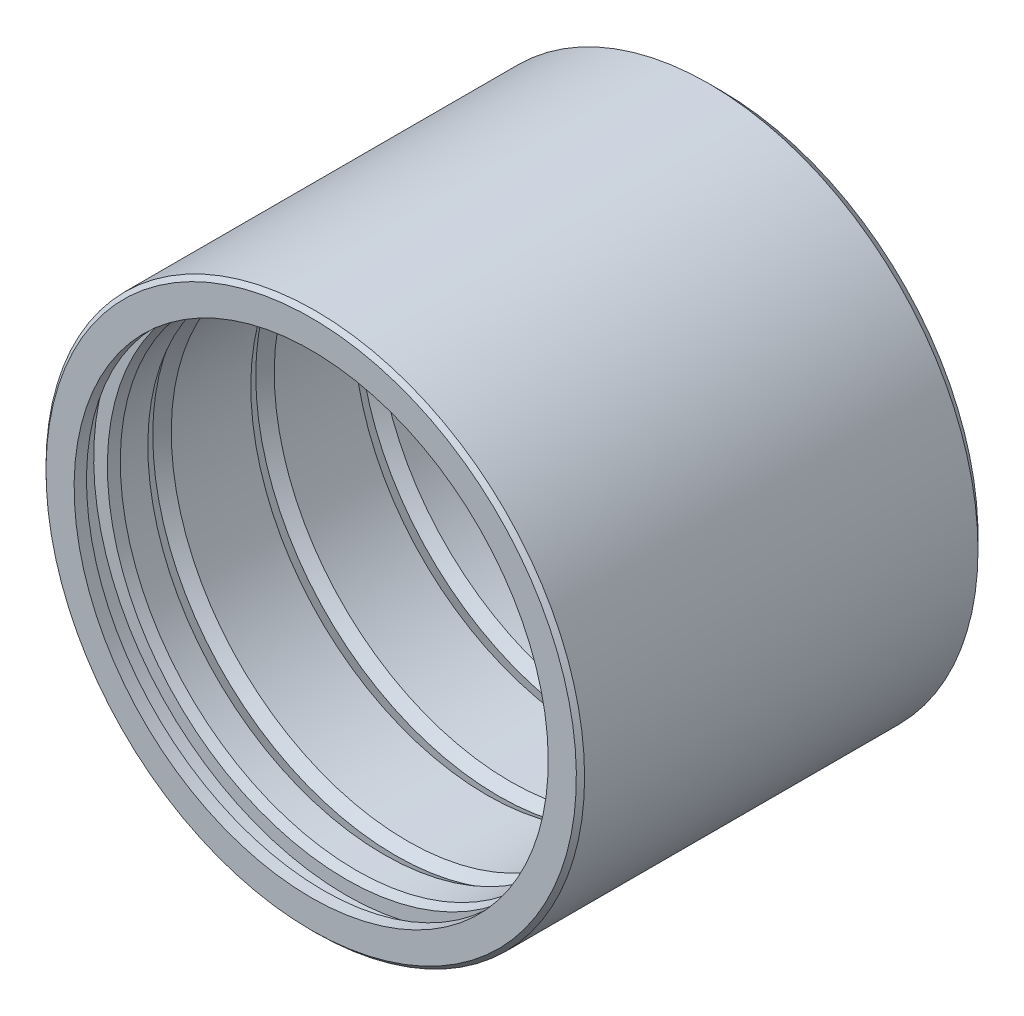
from build123d import *


with BuildPart() as part:
    # Sketch1 → Revolve1 (revolve)
    with BuildSketch(Plane(origin=(0, 0, 0), x_dir=(0, 0, -1), z_dir=(1, 0, 0))):
        Polygon((-97.5, -115.1), (-91.5, -115.1), (-91.5, -122.6), (-80.5, -122.6), (-80.5, -115.95), (-75.55503268, -114.625), (-62.189786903, -114.625), (-56.5, -117.91), (-50.810213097, -114.625), (-12.189786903, -114.625), (-6.5, -117.91), (-0.810213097, -114.625), (37.810213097, -114.625), (43.5, -117.91), (49.189786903, -114.625), (93.009584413, -114.625), (101.5, -116.9), (101.5, -124.75), (95.5, -130.75), (-95.5, -130.75), (-97.5, -128.75), align=None)
    revolve(axis=Axis((0, 0, 114.405553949), (0, 0, -1)))


solid = part.part
